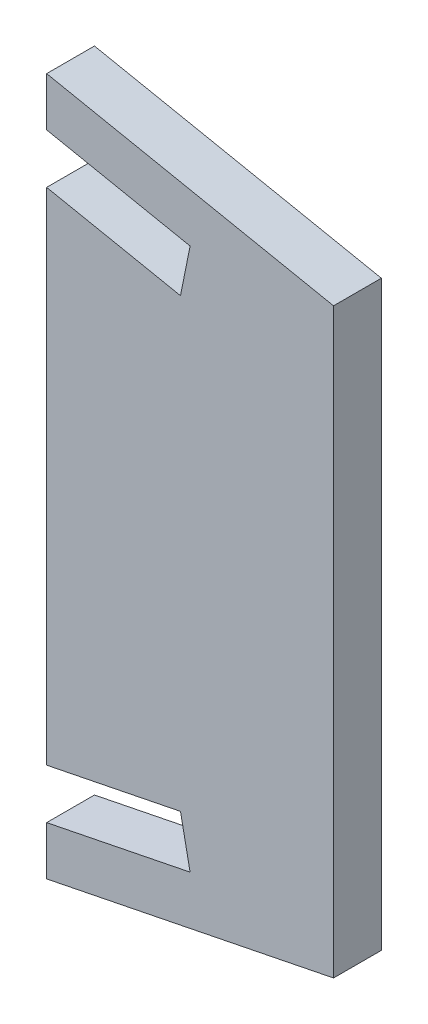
ISO-10303-21;
HEADER;
FILE_DESCRIPTION(('STEP AP214'),'2;1');
FILE_NAME('part.step','',(''),(''),'','','');
FILE_SCHEMA(('AUTOMOTIVE_DESIGN { 1 0 10303 214 1 1 1 1 }'));
ENDSEC;
DATA;
#1=APPLICATION_CONTEXT('core data for automotive mechanical design processes');
#2=APPLICATION_PROTOCOL_DEFINITION('international standard','automotive_design',2000,#1);
#3=PRODUCT_CONTEXT('',#1,'mechanical');
#4=PRODUCT('Part','Part','',(#3));
#5=PRODUCT_RELATED_PRODUCT_CATEGORY('part','',(#4));
#6=PRODUCT_DEFINITION_FORMATION('','',#4);
#7=PRODUCT_DEFINITION_CONTEXT('part definition',#1,'design');
#8=PRODUCT_DEFINITION('design','',#6,#7);
#9=PRODUCT_DEFINITION_SHAPE('','',#8);
#10=(LENGTH_UNIT() NAMED_UNIT(*) SI_UNIT(.MILLI.,.METRE.));
#11=(NAMED_UNIT(*) PLANE_ANGLE_UNIT() SI_UNIT($,.RADIAN.));
#12=(NAMED_UNIT(*) SI_UNIT($,.STERADIAN.) SOLID_ANGLE_UNIT());
#13=UNCERTAINTY_MEASURE_WITH_UNIT(LENGTH_MEASURE(1.E-05),#10,'distance_accuracy_value','');
#14=(GEOMETRIC_REPRESENTATION_CONTEXT(3) GLOBAL_UNCERTAINTY_ASSIGNED_CONTEXT((#13)) GLOBAL_UNIT_ASSIGNED_CONTEXT((#10,
#11,#12)) REPRESENTATION_CONTEXT('',''));
#15=CARTESIAN_POINT('',(0.,0.,0.));
#16=DIRECTION('',(0.,0.,1.));
#17=DIRECTION('',(1.,0.,0.));
#18=AXIS2_PLACEMENT_3D('',#15,#16,#17);
#19=CARTESIAN_POINT('',(-60.,0.,10.));
#20=DIRECTION('',(1.,0.,0.));
#21=DIRECTION('',(0.,1.,0.));
#22=AXIS2_PLACEMENT_3D('',#19,#20,#21);
#23=PLANE('',#22);
#24=DIRECTION('',(0.,-1.,0.));
#25=VECTOR('',#24,1.);
#26=CARTESIAN_POINT('',(-60.,0.,10.));
#27=LINE('',#26,#25);
#28=CARTESIAN_POINT('',(-60.,147.927265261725,10.));
#29=VERTEX_POINT('',#28);
#30=CARTESIAN_POINT('',(-60.,137.727439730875,10.));
#31=VERTEX_POINT('',#30);
#32=EDGE_CURVE('E43',#29,#31,#27,.T.);
#33=ORIENTED_EDGE('',*,*,#32,.F.);
#34=DIRECTION('',(0.,0.,-1.));
#35=VECTOR('',#34,1.);
#36=CARTESIAN_POINT('',(-60.,147.927265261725,10.));
#37=LINE('',#36,#35);
#38=CARTESIAN_POINT('',(-60.,147.927265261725,0.));
#39=VERTEX_POINT('',#38);
#40=EDGE_CURVE('E124',#29,#39,#37,.T.);
#41=ORIENTED_EDGE('',*,*,#40,.T.);
#42=DIRECTION('',(0.,-1.,0.));
#43=VECTOR('',#42,1.);
#44=CARTESIAN_POINT('',(-60.,0.,0.));
#45=LINE('',#44,#43);
#46=CARTESIAN_POINT('',(-60.,137.727439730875,0.));
#47=VERTEX_POINT('',#46);
#48=EDGE_CURVE('E143',#39,#47,#45,.T.);
#49=ORIENTED_EDGE('',*,*,#48,.T.);
#50=DIRECTION('',(0.,0.,1.));
#51=VECTOR('',#50,1.);
#52=CARTESIAN_POINT('',(-60.,137.727439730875,0.));
#53=LINE('',#52,#51);
#54=EDGE_CURVE('E153',#47,#31,#53,.T.);
#55=ORIENTED_EDGE('',*,*,#54,.T.);
#56=EDGE_LOOP('',(#33,#41,#49,#55));
#57=FACE_BOUND('',#56,.T.);
#58=ADVANCED_FACE('F35',(#57),#23,.F.);
#59=CARTESIAN_POINT('',(-60.,127.323617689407,10.));
#60=VERTEX_POINT('',#59);
#61=CARTESIAN_POINT('',(-60.,22.6763823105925,10.));
#62=VERTEX_POINT('',#61);
#63=EDGE_CURVE('E145',#60,#62,#27,.T.);
#64=ORIENTED_EDGE('',*,*,#63,.F.);
#65=DIRECTION('',(0.,0.,1.));
#66=VECTOR('',#65,1.);
#67=CARTESIAN_POINT('',(-60.,127.323617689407,0.));
#68=LINE('',#67,#66);
#69=CARTESIAN_POINT('',(-60.,127.323617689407,0.));
#70=VERTEX_POINT('',#69);
#71=EDGE_CURVE('E167',#70,#60,#68,.T.);
#72=ORIENTED_EDGE('',*,*,#71,.F.);
#73=CARTESIAN_POINT('',(-60.,22.6763823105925,0.));
#74=VERTEX_POINT('',#73);
#75=EDGE_CURVE('E147',#70,#74,#45,.T.);
#76=ORIENTED_EDGE('',*,*,#75,.T.);
#77=DIRECTION('',(0.,0.,1.));
#78=VECTOR('',#77,1.);
#79=CARTESIAN_POINT('',(-60.,22.6763823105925,0.));
#80=LINE('',#79,#78);
#81=EDGE_CURVE('E150',#74,#62,#80,.T.);
#82=ORIENTED_EDGE('',*,*,#81,.T.);
#83=EDGE_LOOP('',(#64,#72,#76,#82));
#84=FACE_BOUND('',#83,.T.);
#85=ADVANCED_FACE('F200',(#84),#23,.F.);
#86=CARTESIAN_POINT('',(0.,0.,10.));
#87=DIRECTION('',(-1.,0.,0.));
#88=DIRECTION('',(0.,-1.,0.));
#89=AXIS2_PLACEMENT_3D('',#86,#87,#88);
#90=PLANE('',#89);
#91=DIRECTION('',(0.,1.,0.));
#92=VECTOR('',#91,1.);
#93=CARTESIAN_POINT('',(0.,0.,0.));
#94=LINE('',#93,#92);
#95=CARTESIAN_POINT('',(0.,14.1272720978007,0.));
#96=VERTEX_POINT('',#95);
#97=CARTESIAN_POINT('',(0.,135.872727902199,0.));
#98=VERTEX_POINT('',#97);
#99=EDGE_CURVE('E136',#96,#98,#94,.T.);
#100=ORIENTED_EDGE('',*,*,#99,.T.);
#101=DIRECTION('',(0.,0.,1.));
#102=VECTOR('',#101,1.);
#103=CARTESIAN_POINT('',(0.,135.872727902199,0.));
#104=LINE('',#103,#102);
#105=CARTESIAN_POINT('',(0.,135.872727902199,10.));
#106=VERTEX_POINT('',#105);
#107=EDGE_CURVE('E58',#98,#106,#104,.T.);
#108=ORIENTED_EDGE('',*,*,#107,.T.);
#109=DIRECTION('',(0.,1.,0.));
#110=VECTOR('',#109,1.);
#111=CARTESIAN_POINT('',(0.,0.,10.));
#112=LINE('',#111,#110);
#113=CARTESIAN_POINT('',(0.,14.1272720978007,10.));
#114=VERTEX_POINT('',#113);
#115=EDGE_CURVE('E134',#114,#106,#112,.T.);
#116=ORIENTED_EDGE('',*,*,#115,.F.);
#117=DIRECTION('',(0.,0.,1.));
#118=VECTOR('',#117,1.);
#119=CARTESIAN_POINT('',(0.,14.1272720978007,0.));
#120=LINE('',#119,#118);
#121=EDGE_CURVE('E128',#96,#114,#120,.T.);
#122=ORIENTED_EDGE('',*,*,#121,.F.);
#123=EDGE_LOOP('',(#100,#108,#116,#122));
#124=FACE_BOUND('',#123,.T.);
#125=ADVANCED_FACE('F37',(#124),#90,.F.);
#126=CARTESIAN_POINT('',(-60.,12.2725602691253,0.));
#127=VERTEX_POINT('',#126);
#128=CARTESIAN_POINT('',(-60.,2.0727347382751,0.));
#129=VERTEX_POINT('',#128);
#130=EDGE_CURVE('E148',#127,#129,#45,.T.);
#131=ORIENTED_EDGE('',*,*,#130,.T.);
#132=DIRECTION('',(0.,0.,1.));
#133=VECTOR('',#132,1.);
#134=CARTESIAN_POINT('',(-60.,2.0727347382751,10.));
#135=LINE('',#134,#133);
#136=CARTESIAN_POINT('',(-60.,2.0727347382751,10.));
#137=VERTEX_POINT('',#136);
#138=EDGE_CURVE('E50',#129,#137,#135,.T.);
#139=ORIENTED_EDGE('',*,*,#138,.T.);
#140=CARTESIAN_POINT('',(-60.,12.2725602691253,10.));
#141=VERTEX_POINT('',#140);
#142=EDGE_CURVE('E142',#141,#137,#27,.T.);
#143=ORIENTED_EDGE('',*,*,#142,.F.);
#144=DIRECTION('',(0.,0.,1.));
#145=VECTOR('',#144,1.);
#146=CARTESIAN_POINT('',(-60.,12.2725602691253,0.));
#147=LINE('',#146,#145);
#148=EDGE_CURVE('E191',#127,#141,#147,.T.);
#149=ORIENTED_EDGE('',*,*,#148,.F.);
#150=EDGE_LOOP('',(#131,#139,#143,#149));
#151=FACE_BOUND('',#150,.T.);
#152=ADVANCED_FACE('F235',(#151),#23,.F.);
#153=CARTESIAN_POINT('',(0.,0.,10.));
#154=DIRECTION('',(0.,0.,1.));
#155=DIRECTION('',(1.,0.,0.));
#156=AXIS2_PLACEMENT_3D('',#153,#154,#155);
#157=PLANE('',#156);
#158=DIRECTION('',(0.980408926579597,-0.196972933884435,0.));
#159=VECTOR('',#158,1.);
#160=CARTESIAN_POINT('',(-70.3167861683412,150.,10.));
#161=LINE('',#160,#159);
#162=EDGE_CURVE('E121',#29,#106,#161,.T.);
#163=ORIENTED_EDGE('',*,*,#162,.F.);
#164=ORIENTED_EDGE('',*,*,#32,.T.);
#165=DIRECTION('',(-0.980408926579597,0.196972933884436,0.));
#166=VECTOR('',#165,1.);
#167=CARTESIAN_POINT('',(-60.,137.727439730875,10.));
#168=LINE('',#167,#166);
#169=CARTESIAN_POINT('',(-30.,131.700171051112,10.));
#170=VERTEX_POINT('',#169);
#171=EDGE_CURVE('E163',#170,#31,#168,.T.);
#172=ORIENTED_EDGE('',*,*,#171,.F.);
#173=DIRECTION('',(0.196972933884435,0.980408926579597,0.));
#174=VECTOR('',#173,1.);
#175=CARTESIAN_POINT('',(-30.,131.700171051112,10.));
#176=LINE('',#175,#174);
#177=CARTESIAN_POINT('',(-32.0091239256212,121.7,10.));
#178=VERTEX_POINT('',#177);
#179=EDGE_CURVE('E212',#178,#170,#176,.T.);
#180=ORIENTED_EDGE('',*,*,#179,.F.);
#181=DIRECTION('',(0.980408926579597,-0.196972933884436,0.));
#182=VECTOR('',#181,1.);
#183=CARTESIAN_POINT('',(-32.0091239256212,121.7,10.));
#184=LINE('',#183,#182);
#185=EDGE_CURVE('E189',#60,#178,#184,.T.);
#186=ORIENTED_EDGE('',*,*,#185,.F.);
#187=ORIENTED_EDGE('',*,*,#63,.T.);
#188=DIRECTION('',(-0.980408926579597,-0.196972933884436,0.));
#189=VECTOR('',#188,1.);
#190=CARTESIAN_POINT('',(-32.0091239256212,28.3,10.));
#191=LINE('',#190,#189);
#192=CARTESIAN_POINT('',(-32.0091239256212,28.3,10.));
#193=VERTEX_POINT('',#192);
#194=EDGE_CURVE('E180',#193,#62,#191,.T.);
#195=ORIENTED_EDGE('',*,*,#194,.F.);
#196=DIRECTION('',(-0.196972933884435,0.980408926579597,0.));
#197=VECTOR('',#196,1.);
#198=CARTESIAN_POINT('',(-30.,18.2998289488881,10.));
#199=LINE('',#198,#197);
#200=CARTESIAN_POINT('',(-30.,18.2998289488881,10.));
#201=VERTEX_POINT('',#200);
#202=EDGE_CURVE('E174',#201,#193,#199,.T.);
#203=ORIENTED_EDGE('',*,*,#202,.F.);
#204=DIRECTION('',(0.980408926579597,0.196972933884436,0.));
#205=VECTOR('',#204,1.);
#206=CARTESIAN_POINT('',(-60.,12.2725602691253,10.));
#207=LINE('',#206,#205);
#208=EDGE_CURVE('E182',#141,#201,#207,.T.);
#209=ORIENTED_EDGE('',*,*,#208,.F.);
#210=ORIENTED_EDGE('',*,*,#142,.T.);
#211=DIRECTION('',(-0.980408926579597,-0.196972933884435,0.));
#212=VECTOR('',#211,1.);
#213=CARTESIAN_POINT('',(-70.3167861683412,0.,10.));
#214=LINE('',#213,#212);
#215=EDGE_CURVE('E141',#114,#137,#214,.T.);
#216=ORIENTED_EDGE('',*,*,#215,.F.);
#217=ORIENTED_EDGE('',*,*,#115,.T.);
#218=EDGE_LOOP('',(#163,#164,#172,#180,#186,#187,#195,#203,#209,#210,#216,#217));
#219=FACE_BOUND('',#218,.T.);
#220=ADVANCED_FACE('F139',(#219),#157,.T.);
#221=CARTESIAN_POINT('',(0.,0.,0.));
#222=DIRECTION('',(0.,0.,1.));
#223=DIRECTION('',(1.,0.,0.));
#224=AXIS2_PLACEMENT_3D('',#221,#222,#223);
#225=PLANE('',#224);
#226=ORIENTED_EDGE('',*,*,#48,.F.);
#227=DIRECTION('',(0.980408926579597,-0.196972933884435,0.));
#228=VECTOR('',#227,1.);
#229=CARTESIAN_POINT('',(26.2389290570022,130.601092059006,0.));
#230=LINE('',#229,#228);
#231=EDGE_CURVE('E11',#39,#98,#230,.T.);
#232=ORIENTED_EDGE('',*,*,#231,.T.);
#233=ORIENTED_EDGE('',*,*,#99,.F.);
#234=DIRECTION('',(-0.980408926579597,-0.196972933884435,0.));
#235=VECTOR('',#234,1.);
#236=CARTESIAN_POINT('',(-70.3167861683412,0.,0.));
#237=LINE('',#236,#235);
#238=EDGE_CURVE('E228',#96,#129,#237,.T.);
#239=ORIENTED_EDGE('',*,*,#238,.T.);
#240=ORIENTED_EDGE('',*,*,#130,.F.);
#241=DIRECTION('',(0.980408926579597,0.196972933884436,0.));
#242=VECTOR('',#241,1.);
#243=CARTESIAN_POINT('',(-60.,12.2725602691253,0.));
#244=LINE('',#243,#242);
#245=CARTESIAN_POINT('',(-30.,18.2998289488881,0.));
#246=VERTEX_POINT('',#245);
#247=EDGE_CURVE('E173',#127,#246,#244,.T.);
#248=ORIENTED_EDGE('',*,*,#247,.T.);
#249=DIRECTION('',(-0.196972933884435,0.980408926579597,0.));
#250=VECTOR('',#249,1.);
#251=CARTESIAN_POINT('',(-30.,18.2998289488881,0.));
#252=LINE('',#251,#250);
#253=CARTESIAN_POINT('',(-32.0091239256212,28.3,0.));
#254=VERTEX_POINT('',#253);
#255=EDGE_CURVE('E177',#246,#254,#252,.T.);
#256=ORIENTED_EDGE('',*,*,#255,.T.);
#257=DIRECTION('',(-0.980408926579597,-0.196972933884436,0.));
#258=VECTOR('',#257,1.);
#259=CARTESIAN_POINT('',(-32.0091239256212,28.3,0.));
#260=LINE('',#259,#258);
#261=EDGE_CURVE('E170',#254,#74,#260,.T.);
#262=ORIENTED_EDGE('',*,*,#261,.T.);
#263=ORIENTED_EDGE('',*,*,#75,.F.);
#264=DIRECTION('',(0.980408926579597,-0.196972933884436,0.));
#265=VECTOR('',#264,1.);
#266=CARTESIAN_POINT('',(-32.0091239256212,121.7,0.));
#267=LINE('',#266,#265);
#268=CARTESIAN_POINT('',(-32.0091239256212,121.7,0.));
#269=VERTEX_POINT('',#268);
#270=EDGE_CURVE('E222',#70,#269,#267,.T.);
#271=ORIENTED_EDGE('',*,*,#270,.T.);
#272=DIRECTION('',(0.196972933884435,0.980408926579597,0.));
#273=VECTOR('',#272,1.);
#274=CARTESIAN_POINT('',(-30.,131.700171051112,0.));
#275=LINE('',#274,#273);
#276=CARTESIAN_POINT('',(-30.,131.700171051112,0.));
#277=VERTEX_POINT('',#276);
#278=EDGE_CURVE('E219',#269,#277,#275,.T.);
#279=ORIENTED_EDGE('',*,*,#278,.T.);
#280=DIRECTION('',(-0.980408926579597,0.196972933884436,0.));
#281=VECTOR('',#280,1.);
#282=CARTESIAN_POINT('',(-60.,137.727439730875,0.));
#283=LINE('',#282,#281);
#284=EDGE_CURVE('E169',#277,#47,#283,.T.);
#285=ORIENTED_EDGE('',*,*,#284,.T.);
#286=EDGE_LOOP('',(#226,#232,#233,#239,#240,#248,#256,#262,#263,#271,#279,#285));
#287=FACE_BOUND('',#286,.T.);
#288=ADVANCED_FACE('F233',(#287),#225,.F.);
#289=CARTESIAN_POINT('',(-32.0091239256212,28.3,0.));
#290=DIRECTION('',(-0.196972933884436,0.980408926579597,0.));
#291=DIRECTION('',(-0.980408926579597,-0.196972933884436,0.));
#292=AXIS2_PLACEMENT_3D('',#289,#290,#291);
#293=PLANE('',#292);
#294=ORIENTED_EDGE('',*,*,#194,.T.);
#295=ORIENTED_EDGE('',*,*,#81,.F.);
#296=ORIENTED_EDGE('',*,*,#261,.F.);
#297=DIRECTION('',(0.,0.,1.));
#298=VECTOR('',#297,1.);
#299=CARTESIAN_POINT('',(-32.0091239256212,28.3,0.));
#300=LINE('',#299,#298);
#301=EDGE_CURVE('E187',#254,#193,#300,.T.);
#302=ORIENTED_EDGE('',*,*,#301,.T.);
#303=EDGE_LOOP('',(#294,#295,#296,#302));
#304=FACE_BOUND('',#303,.T.);
#305=ADVANCED_FACE('F241',(#304),#293,.F.);
#306=CARTESIAN_POINT('',(-30.,18.2998289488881,0.));
#307=DIRECTION('',(0.980408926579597,0.196972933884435,0.));
#308=DIRECTION('',(-0.196972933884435,0.980408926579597,0.));
#309=AXIS2_PLACEMENT_3D('',#306,#307,#308);
#310=PLANE('',#309);
#311=ORIENTED_EDGE('',*,*,#202,.T.);
#312=ORIENTED_EDGE('',*,*,#301,.F.);
#313=ORIENTED_EDGE('',*,*,#255,.F.);
#314=DIRECTION('',(0.,0.,1.));
#315=VECTOR('',#314,1.);
#316=CARTESIAN_POINT('',(-30.,18.2998289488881,0.));
#317=LINE('',#316,#315);
#318=EDGE_CURVE('E190',#246,#201,#317,.T.);
#319=ORIENTED_EDGE('',*,*,#318,.T.);
#320=EDGE_LOOP('',(#311,#312,#313,#319));
#321=FACE_BOUND('',#320,.T.);
#322=ADVANCED_FACE('F240',(#321),#310,.F.);
#323=CARTESIAN_POINT('',(-60.,12.2725602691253,0.));
#324=DIRECTION('',(0.196972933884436,-0.980408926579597,0.));
#325=DIRECTION('',(0.980408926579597,0.196972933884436,0.));
#326=AXIS2_PLACEMENT_3D('',#323,#324,#325);
#327=PLANE('',#326);
#328=ORIENTED_EDGE('',*,*,#208,.T.);
#329=ORIENTED_EDGE('',*,*,#318,.F.);
#330=ORIENTED_EDGE('',*,*,#247,.F.);
#331=ORIENTED_EDGE('',*,*,#148,.T.);
#332=EDGE_LOOP('',(#328,#329,#330,#331));
#333=FACE_BOUND('',#332,.T.);
#334=ADVANCED_FACE('F238',(#333),#327,.F.);
#335=CARTESIAN_POINT('',(-60.,137.727439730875,0.));
#336=DIRECTION('',(0.196972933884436,0.980408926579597,0.));
#337=DIRECTION('',(-0.980408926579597,0.196972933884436,0.));
#338=AXIS2_PLACEMENT_3D('',#335,#336,#337);
#339=PLANE('',#338);
#340=ORIENTED_EDGE('',*,*,#171,.T.);
#341=ORIENTED_EDGE('',*,*,#54,.F.);
#342=ORIENTED_EDGE('',*,*,#284,.F.);
#343=DIRECTION('',(0.,0.,1.));
#344=VECTOR('',#343,1.);
#345=CARTESIAN_POINT('',(-30.,131.700171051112,0.));
#346=LINE('',#345,#344);
#347=EDGE_CURVE('E156',#277,#170,#346,.T.);
#348=ORIENTED_EDGE('',*,*,#347,.T.);
#349=EDGE_LOOP('',(#340,#341,#342,#348));
#350=FACE_BOUND('',#349,.T.);
#351=ADVANCED_FACE('F288',(#350),#339,.F.);
#352=CARTESIAN_POINT('',(-30.,131.700171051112,0.));
#353=DIRECTION('',(0.980408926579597,-0.196972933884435,0.));
#354=DIRECTION('',(0.196972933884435,0.980408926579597,0.));
#355=AXIS2_PLACEMENT_3D('',#352,#353,#354);
#356=PLANE('',#355);
#357=ORIENTED_EDGE('',*,*,#179,.T.);
#358=ORIENTED_EDGE('',*,*,#347,.F.);
#359=ORIENTED_EDGE('',*,*,#278,.F.);
#360=DIRECTION('',(0.,0.,1.));
#361=VECTOR('',#360,1.);
#362=CARTESIAN_POINT('',(-32.0091239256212,121.7,0.));
#363=LINE('',#362,#361);
#364=EDGE_CURVE('E160',#269,#178,#363,.T.);
#365=ORIENTED_EDGE('',*,*,#364,.T.);
#366=EDGE_LOOP('',(#357,#358,#359,#365));
#367=FACE_BOUND('',#366,.T.);
#368=ADVANCED_FACE('F296',(#367),#356,.F.);
#369=CARTESIAN_POINT('',(-32.0091239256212,121.7,0.));
#370=DIRECTION('',(-0.196972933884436,-0.980408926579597,0.));
#371=DIRECTION('',(0.980408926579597,-0.196972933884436,0.));
#372=AXIS2_PLACEMENT_3D('',#369,#370,#371);
#373=PLANE('',#372);
#374=ORIENTED_EDGE('',*,*,#185,.T.);
#375=ORIENTED_EDGE('',*,*,#364,.F.);
#376=ORIENTED_EDGE('',*,*,#270,.F.);
#377=ORIENTED_EDGE('',*,*,#71,.T.);
#378=EDGE_LOOP('',(#374,#375,#376,#377));
#379=FACE_BOUND('',#378,.T.);
#380=ADVANCED_FACE('F306',(#379),#373,.F.);
#381=CARTESIAN_POINT('',(-70.3167861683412,0.,0.));
#382=DIRECTION('',(-0.196972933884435,0.980408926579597,0.));
#383=DIRECTION('',(-0.980408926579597,-0.196972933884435,0.));
#384=AXIS2_PLACEMENT_3D('',#381,#382,#383);
#385=PLANE('',#384);
#386=ORIENTED_EDGE('',*,*,#238,.F.);
#387=ORIENTED_EDGE('',*,*,#121,.T.);
#388=ORIENTED_EDGE('',*,*,#215,.T.);
#389=ORIENTED_EDGE('',*,*,#138,.F.);
#390=EDGE_LOOP('',(#386,#387,#388,#389));
#391=FACE_BOUND('',#390,.T.);
#392=ADVANCED_FACE('F315',(#391),#385,.F.);
#393=CARTESIAN_POINT('',(-70.3167861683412,150.,0.));
#394=DIRECTION('',(-0.196972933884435,-0.980408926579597,0.));
#395=DIRECTION('',(0.980408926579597,-0.196972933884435,0.));
#396=AXIS2_PLACEMENT_3D('',#393,#394,#395);
#397=PLANE('',#396);
#398=ORIENTED_EDGE('',*,*,#162,.T.);
#399=ORIENTED_EDGE('',*,*,#107,.F.);
#400=ORIENTED_EDGE('',*,*,#231,.F.);
#401=ORIENTED_EDGE('',*,*,#40,.F.);
#402=EDGE_LOOP('',(#398,#399,#400,#401));
#403=FACE_BOUND('',#402,.T.);
#404=ADVANCED_FACE('F122',(#403),#397,.F.);
#405=CLOSED_SHELL('',(#58,#85,#125,#152,#220,#288,#305,#322,#334,#351,#368,#380,#392,#404));
#406=MANIFOLD_SOLID_BREP('B2',#405);
#407=ADVANCED_BREP_SHAPE_REPRESENTATION('',(#18,#406),#14);
#408=SHAPE_DEFINITION_REPRESENTATION(#9,#407);
ENDSEC;
END-ISO-10303-21;
